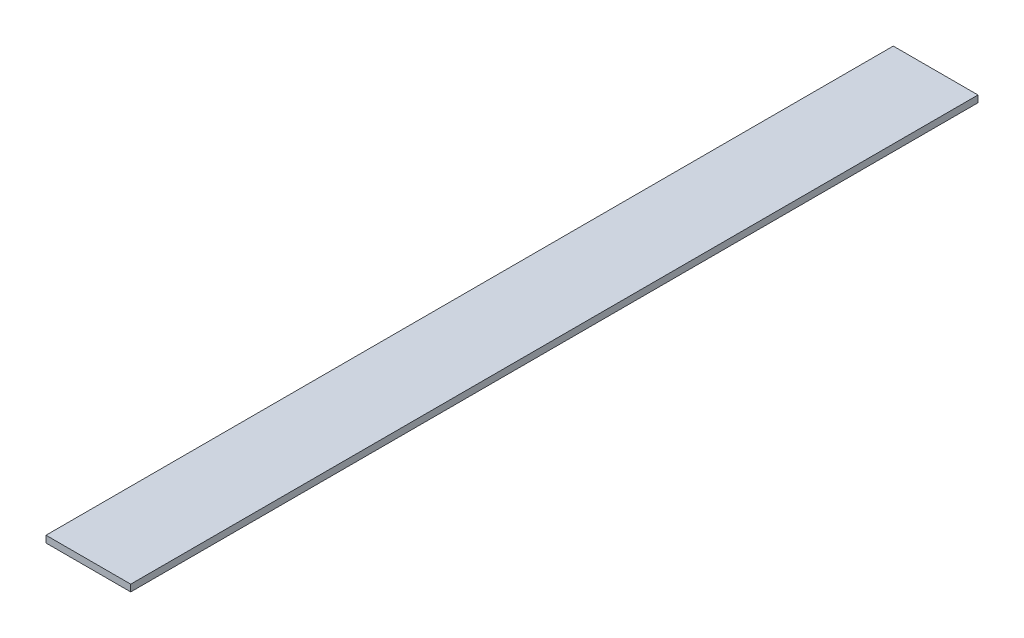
ISO-10303-21;
HEADER;
FILE_DESCRIPTION(('STEP AP214'),'2;1');
FILE_NAME('part.step','',(''),(''),'','','');
FILE_SCHEMA(('AUTOMOTIVE_DESIGN { 1 0 10303 214 1 1 1 1 }'));
ENDSEC;
DATA;
#1=APPLICATION_CONTEXT('core data for automotive mechanical design processes');
#2=APPLICATION_PROTOCOL_DEFINITION('international standard','automotive_design',2000,#1);
#3=PRODUCT_CONTEXT('',#1,'mechanical');
#4=PRODUCT('Part','Part','',(#3));
#5=PRODUCT_RELATED_PRODUCT_CATEGORY('part','',(#4));
#6=PRODUCT_DEFINITION_FORMATION('','',#4);
#7=PRODUCT_DEFINITION_CONTEXT('part definition',#1,'design');
#8=PRODUCT_DEFINITION('design','',#6,#7);
#9=PRODUCT_DEFINITION_SHAPE('','',#8);
#10=(LENGTH_UNIT() NAMED_UNIT(*) SI_UNIT(.MILLI.,.METRE.));
#11=(NAMED_UNIT(*) PLANE_ANGLE_UNIT() SI_UNIT($,.RADIAN.));
#12=(NAMED_UNIT(*) SI_UNIT($,.STERADIAN.) SOLID_ANGLE_UNIT());
#13=UNCERTAINTY_MEASURE_WITH_UNIT(LENGTH_MEASURE(1.E-05),#10,'distance_accuracy_value','');
#14=(GEOMETRIC_REPRESENTATION_CONTEXT(3) GLOBAL_UNCERTAINTY_ASSIGNED_CONTEXT((#13)) GLOBAL_UNIT_ASSIGNED_CONTEXT((#10,
#11,#12)) REPRESENTATION_CONTEXT('',''));
#15=CARTESIAN_POINT('',(0.,0.,0.));
#16=DIRECTION('',(0.,0.,1.));
#17=DIRECTION('',(1.,0.,0.));
#18=AXIS2_PLACEMENT_3D('',#15,#16,#17);
#19=CARTESIAN_POINT('',(25.,0.,0.));
#20=DIRECTION('',(-1.,0.,0.));
#21=DIRECTION('',(0.,0.,1.));
#22=AXIS2_PLACEMENT_3D('',#19,#20,#21);
#23=PLANE('',#22);
#24=DIRECTION('',(0.,-1.,0.));
#25=VECTOR('',#24,1.);
#26=CARTESIAN_POINT('',(25.,2.,0.));
#27=LINE('',#26,#25);
#28=CARTESIAN_POINT('',(25.,4.,0.));
#29=VERTEX_POINT('',#28);
#30=CARTESIAN_POINT('',(25.,0.,0.));
#31=VERTEX_POINT('',#30);
#32=EDGE_CURVE('E51',#29,#31,#27,.T.);
#33=ORIENTED_EDGE('',*,*,#32,.F.);
#34=DIRECTION('',(0.,0.,-1.));
#35=VECTOR('',#34,1.);
#36=CARTESIAN_POINT('',(25.,4.,250.));
#37=LINE('',#36,#35);
#38=CARTESIAN_POINT('',(25.,4.,500.));
#39=VERTEX_POINT('',#38);
#40=EDGE_CURVE('E66',#39,#29,#37,.T.);
#41=ORIENTED_EDGE('',*,*,#40,.F.);
#42=DIRECTION('',(0.,-1.,0.));
#43=VECTOR('',#42,1.);
#44=CARTESIAN_POINT('',(25.,2.,500.));
#45=LINE('',#44,#43);
#46=CARTESIAN_POINT('',(25.,0.,500.));
#47=VERTEX_POINT('',#46);
#48=EDGE_CURVE('E18',#39,#47,#45,.T.);
#49=ORIENTED_EDGE('',*,*,#48,.T.);
#50=DIRECTION('',(0.,0.,1.));
#51=VECTOR('',#50,1.);
#52=CARTESIAN_POINT('',(25.,0.,250.));
#53=LINE('',#52,#51);
#54=EDGE_CURVE('E56',#31,#47,#53,.T.);
#55=ORIENTED_EDGE('',*,*,#54,.F.);
#56=EDGE_LOOP('',(#33,#41,#49,#55));
#57=FACE_BOUND('',#56,.T.);
#58=ADVANCED_FACE('F14',(#57),#23,.F.);
#59=CARTESIAN_POINT('',(25.,0.,500.));
#60=DIRECTION('',(0.,0.,-1.));
#61=DIRECTION('',(-1.,0.,0.));
#62=AXIS2_PLACEMENT_3D('',#59,#60,#61);
#63=PLANE('',#62);
#64=DIRECTION('',(-1.,0.,0.));
#65=VECTOR('',#64,1.);
#66=CARTESIAN_POINT('',(0.,0.,500.));
#67=LINE('',#66,#65);
#68=CARTESIAN_POINT('',(-25.,0.,500.));
#69=VERTEX_POINT('',#68);
#70=EDGE_CURVE('E61',#47,#69,#67,.T.);
#71=ORIENTED_EDGE('',*,*,#70,.F.);
#72=ORIENTED_EDGE('',*,*,#48,.F.);
#73=DIRECTION('',(1.,0.,0.));
#74=VECTOR('',#73,1.);
#75=CARTESIAN_POINT('',(0.,4.,500.));
#76=LINE('',#75,#74);
#77=CARTESIAN_POINT('',(-25.,4.,500.));
#78=VERTEX_POINT('',#77);
#79=EDGE_CURVE('E79',#78,#39,#76,.T.);
#80=ORIENTED_EDGE('',*,*,#79,.F.);
#81=DIRECTION('',(0.,-1.,0.));
#82=VECTOR('',#81,1.);
#83=CARTESIAN_POINT('',(-25.,2.,500.));
#84=LINE('',#83,#82);
#85=EDGE_CURVE('E72',#78,#69,#84,.T.);
#86=ORIENTED_EDGE('',*,*,#85,.T.);
#87=EDGE_LOOP('',(#71,#72,#80,#86));
#88=FACE_BOUND('',#87,.T.);
#89=ADVANCED_FACE('F71',(#88),#63,.F.);
#90=CARTESIAN_POINT('',(-25.,0.,500.));
#91=DIRECTION('',(0.,-1.,0.));
#92=DIRECTION('',(0.,0.,-1.));
#93=AXIS2_PLACEMENT_3D('',#90,#91,#92);
#94=PLANE('',#93);
#95=ORIENTED_EDGE('',*,*,#70,.T.);
#96=DIRECTION('',(0.,0.,-1.));
#97=VECTOR('',#96,1.);
#98=CARTESIAN_POINT('',(-25.,0.,250.));
#99=LINE('',#98,#97);
#100=CARTESIAN_POINT('',(-25.,0.,0.));
#101=VERTEX_POINT('',#100);
#102=EDGE_CURVE('E82',#69,#101,#99,.T.);
#103=ORIENTED_EDGE('',*,*,#102,.T.);
#104=DIRECTION('',(-1.,0.,0.));
#105=VECTOR('',#104,1.);
#106=CARTESIAN_POINT('',(0.,0.,0.));
#107=LINE('',#106,#105);
#108=EDGE_CURVE('E63',#31,#101,#107,.T.);
#109=ORIENTED_EDGE('',*,*,#108,.F.);
#110=ORIENTED_EDGE('',*,*,#54,.T.);
#111=EDGE_LOOP('',(#95,#103,#109,#110));
#112=FACE_BOUND('',#111,.T.);
#113=ADVANCED_FACE('F58',(#112),#94,.T.);
#114=CARTESIAN_POINT('',(25.,0.,0.));
#115=DIRECTION('',(0.,0.,-1.));
#116=DIRECTION('',(-1.,0.,0.));
#117=AXIS2_PLACEMENT_3D('',#114,#115,#116);
#118=PLANE('',#117);
#119=ORIENTED_EDGE('',*,*,#32,.T.);
#120=ORIENTED_EDGE('',*,*,#108,.T.);
#121=DIRECTION('',(0.,1.,0.));
#122=VECTOR('',#121,1.);
#123=CARTESIAN_POINT('',(-25.,2.,0.));
#124=LINE('',#123,#122);
#125=CARTESIAN_POINT('',(-25.,4.,0.));
#126=VERTEX_POINT('',#125);
#127=EDGE_CURVE('E24',#101,#126,#124,.T.);
#128=ORIENTED_EDGE('',*,*,#127,.T.);
#129=DIRECTION('',(-1.,0.,0.));
#130=VECTOR('',#129,1.);
#131=CARTESIAN_POINT('',(0.,4.,0.));
#132=LINE('',#131,#130);
#133=EDGE_CURVE('E32',#29,#126,#132,.T.);
#134=ORIENTED_EDGE('',*,*,#133,.F.);
#135=EDGE_LOOP('',(#119,#120,#128,#134));
#136=FACE_BOUND('',#135,.T.);
#137=ADVANCED_FACE('F86',(#136),#118,.T.);
#138=CARTESIAN_POINT('',(25.,4.,0.));
#139=DIRECTION('',(0.,1.,0.));
#140=DIRECTION('',(-1.,0.,0.));
#141=AXIS2_PLACEMENT_3D('',#138,#139,#140);
#142=PLANE('',#141);
#143=DIRECTION('',(0.,0.,1.));
#144=VECTOR('',#143,1.);
#145=CARTESIAN_POINT('',(-25.,4.,250.));
#146=LINE('',#145,#144);
#147=EDGE_CURVE('E9',#126,#78,#146,.T.);
#148=ORIENTED_EDGE('',*,*,#147,.T.);
#149=ORIENTED_EDGE('',*,*,#79,.T.);
#150=ORIENTED_EDGE('',*,*,#40,.T.);
#151=ORIENTED_EDGE('',*,*,#133,.T.);
#152=EDGE_LOOP('',(#148,#149,#150,#151));
#153=FACE_BOUND('',#152,.T.);
#154=ADVANCED_FACE('F88',(#153),#142,.T.);
#155=CARTESIAN_POINT('',(-25.,0.,500.));
#156=DIRECTION('',(1.,0.,0.));
#157=DIRECTION('',(0.,0.,-1.));
#158=AXIS2_PLACEMENT_3D('',#155,#156,#157);
#159=PLANE('',#158);
#160=ORIENTED_EDGE('',*,*,#127,.F.);
#161=ORIENTED_EDGE('',*,*,#102,.F.);
#162=ORIENTED_EDGE('',*,*,#85,.F.);
#163=ORIENTED_EDGE('',*,*,#147,.F.);
#164=EDGE_LOOP('',(#160,#161,#162,#163));
#165=FACE_BOUND('',#164,.T.);
#166=ADVANCED_FACE('F16',(#165),#159,.F.);
#167=CLOSED_SHELL('',(#58,#89,#113,#137,#154,#166));
#168=MANIFOLD_SOLID_BREP('B1',#167);
#169=ADVANCED_BREP_SHAPE_REPRESENTATION('',(#18,#168),#14);
#170=SHAPE_DEFINITION_REPRESENTATION(#9,#169);
ENDSEC;
END-ISO-10303-21;
